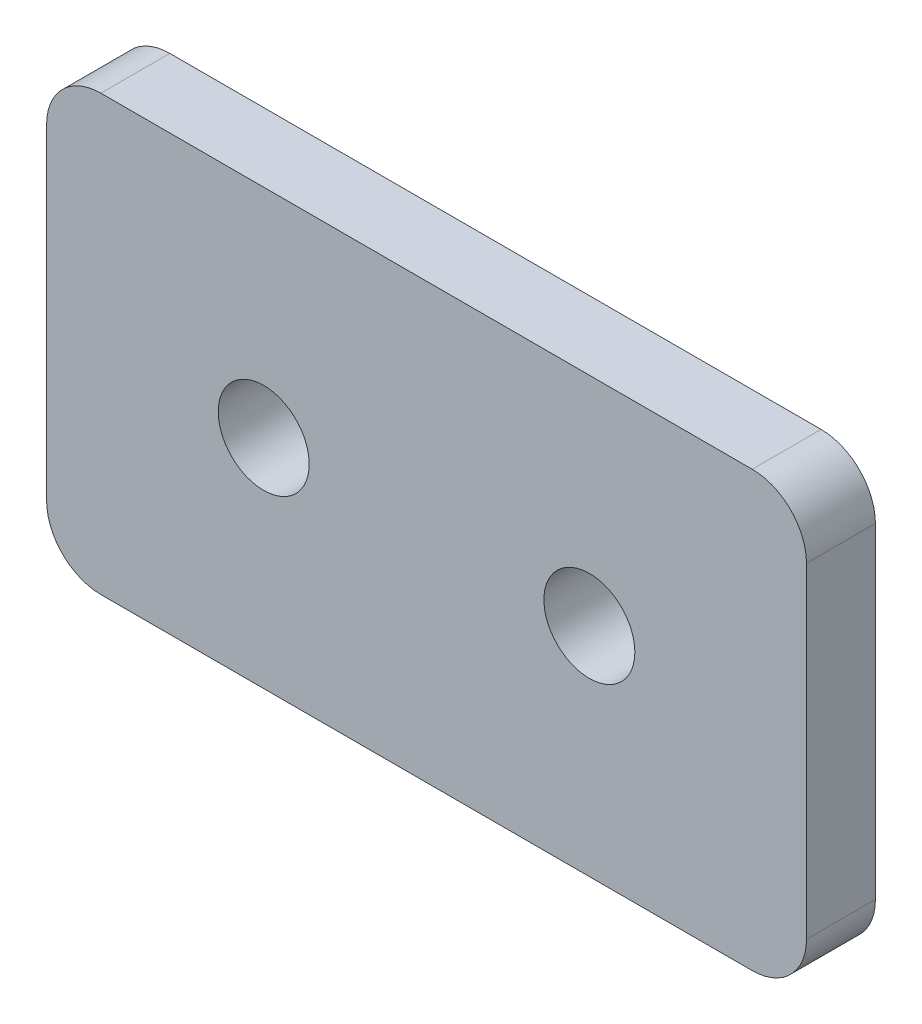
from build123d import *

# Parameters (mm, degrees)
SKETCH1_W           = 35
SKETCH1_H           = 20
SKETCH1_R           = 2.095
BOSS_EXTRUDE2_DEPTH = 3.175
FILLET2_R           = 2.5


with BuildPart() as part:
    # Sketch1 → Boss-Extrude2 (new body)
    with BuildSketch(Plane.XY):
        with Locations((7.5, 0)):
            Rectangle(SKETCH1_W, SKETCH1_H)
        Circle(SKETCH1_R, mode=Mode.SUBTRACT)
        with Locations((15, 0)):
            Circle(SKETCH1_R, mode=Mode.SUBTRACT)
    extrude(amount=BOSS_EXTRUDE2_DEPTH)

    # Fillet2
    fillet2_edges = [part.edges().sort_by_distance(p)[0] for p in [
        (25, -10, 1.5875),
        (-10, -10, 1.5875),
        (-10, 10, 1.5875),
        (25, 10, 1.5875),
    ]]
    fillet(fillet2_edges, radius=FILLET2_R)


solid = part.part
